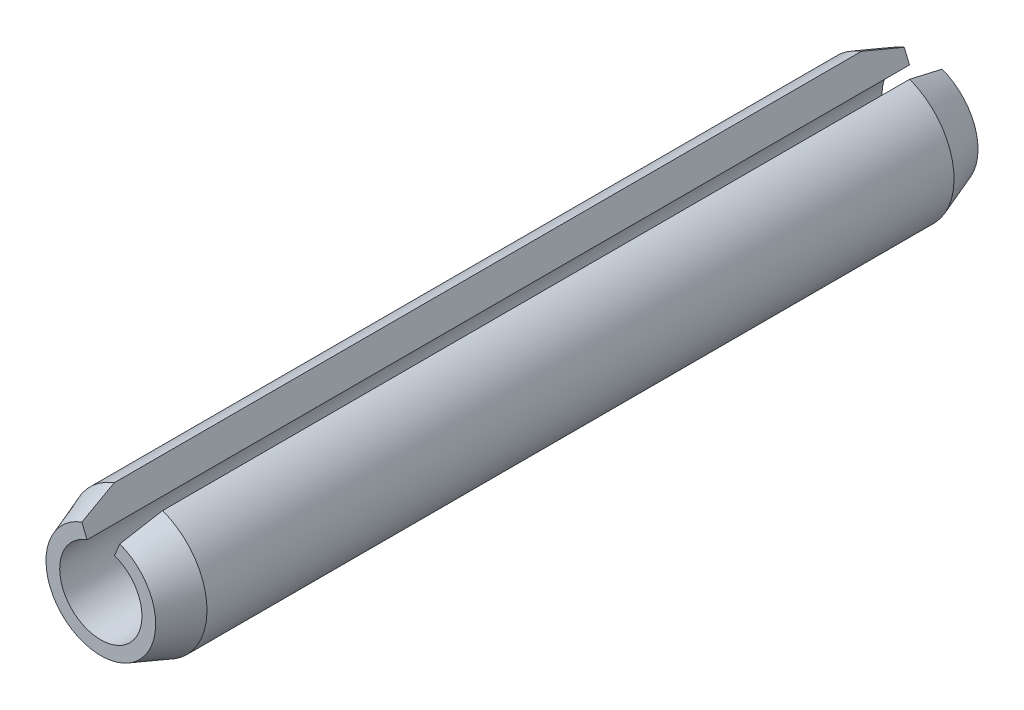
ISO-10303-21;
HEADER;
FILE_DESCRIPTION(('STEP AP214'),'2;1');
FILE_NAME('part.step','',(''),(''),'','','');
FILE_SCHEMA(('AUTOMOTIVE_DESIGN { 1 0 10303 214 1 1 1 1 }'));
ENDSEC;
DATA;
#1=APPLICATION_CONTEXT('core data for automotive mechanical design processes');
#2=APPLICATION_PROTOCOL_DEFINITION('international standard','automotive_design',2000,#1);
#3=PRODUCT_CONTEXT('',#1,'mechanical');
#4=PRODUCT('Part','Part','',(#3));
#5=PRODUCT_RELATED_PRODUCT_CATEGORY('part','',(#4));
#6=PRODUCT_DEFINITION_FORMATION('','',#4);
#7=PRODUCT_DEFINITION_CONTEXT('part definition',#1,'design');
#8=PRODUCT_DEFINITION('design','',#6,#7);
#9=PRODUCT_DEFINITION_SHAPE('','',#8);
#10=(LENGTH_UNIT() NAMED_UNIT(*) SI_UNIT(.MILLI.,.METRE.));
#11=(NAMED_UNIT(*) PLANE_ANGLE_UNIT() SI_UNIT($,.RADIAN.));
#12=(NAMED_UNIT(*) SI_UNIT($,.STERADIAN.) SOLID_ANGLE_UNIT());
#13=UNCERTAINTY_MEASURE_WITH_UNIT(LENGTH_MEASURE(1.E-05),#10,'distance_accuracy_value','');
#14=(GEOMETRIC_REPRESENTATION_CONTEXT(3) GLOBAL_UNCERTAINTY_ASSIGNED_CONTEXT((#13)) GLOBAL_UNIT_ASSIGNED_CONTEXT((#10,
#11,#12)) REPRESENTATION_CONTEXT('',''));
#15=CARTESIAN_POINT('',(0.,0.,0.));
#16=DIRECTION('',(0.,0.,1.));
#17=DIRECTION('',(1.,0.,0.));
#18=AXIS2_PLACEMENT_3D('',#15,#16,#17);
#19=CARTESIAN_POINT('',(0.,0.,30.));
#20=DIRECTION('',(0.,0.,-1.));
#21=DIRECTION('',(-1.,0.,0.));
#22=AXIS2_PLACEMENT_3D('',#19,#20,#21);
#23=CYLINDRICAL_SURFACE('',#22,3.);
#24=CARTESIAN_POINT('',(0.,0.,-30.));
#25=DIRECTION('',(0.,0.,1.));
#26=DIRECTION('',(0.,1.,0.));
#27=AXIS2_PLACEMENT_3D('',#24,#25,#26);
#28=CIRCLE('',#27,3.);
#29=CARTESIAN_POINT('',(-1.,2.82842712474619,-30.));
#30=VERTEX_POINT('',#29);
#31=CARTESIAN_POINT('',(1.,2.82842712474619,-30.));
#32=VERTEX_POINT('',#31);
#33=EDGE_CURVE('E74',#30,#32,#28,.T.);
#34=ORIENTED_EDGE('',*,*,#33,.F.);
#35=DIRECTION('',(0.,0.,-1.));
#36=VECTOR('',#35,1.);
#37=CARTESIAN_POINT('',(-1.,2.82842712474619,30.));
#38=LINE('',#37,#36);
#39=CARTESIAN_POINT('',(-1.,2.82842712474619,30.));
#40=VERTEX_POINT('',#39);
#41=EDGE_CURVE('E106',#40,#30,#38,.T.);
#42=ORIENTED_EDGE('',*,*,#41,.F.);
#43=CARTESIAN_POINT('',(0.,0.,30.));
#44=DIRECTION('',(0.,0.,1.));
#45=DIRECTION('',(0.,1.,0.));
#46=AXIS2_PLACEMENT_3D('',#43,#44,#45);
#47=CIRCLE('',#46,3.);
#48=CARTESIAN_POINT('',(1.,2.82842712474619,30.));
#49=VERTEX_POINT('',#48);
#50=EDGE_CURVE('E76',#40,#49,#47,.T.);
#51=ORIENTED_EDGE('',*,*,#50,.T.);
#52=DIRECTION('',(0.,0.,-1.));
#53=VECTOR('',#52,1.);
#54=CARTESIAN_POINT('',(1.,2.82842712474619,30.));
#55=LINE('',#54,#53);
#56=EDGE_CURVE('E70',#49,#32,#55,.T.);
#57=ORIENTED_EDGE('',*,*,#56,.T.);
#58=EDGE_LOOP('',(#34,#42,#51,#57));
#59=FACE_BOUND('',#58,.T.);
#60=ADVANCED_FACE('F14',(#59),#23,.F.);
#61=CARTESIAN_POINT('',(1.,2.82842712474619,30.));
#62=DIRECTION('',(-0.924624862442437,0.380879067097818,0.));
#63=DIRECTION('',(-0.380879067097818,-0.924624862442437,0.));
#64=AXIS2_PLACEMENT_3D('',#61,#62,#63);
#65=PLANE('',#64);
#66=DIRECTION('',(0.,0.,-1.));
#67=VECTOR('',#66,1.);
#68=CARTESIAN_POINT('',(1.7623506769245,4.67911531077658,30.));
#69=LINE('',#68,#67);
#70=CARTESIAN_POINT('',(1.7623506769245,4.67911531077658,27.2525225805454));
#71=VERTEX_POINT('',#70);
#72=CARTESIAN_POINT('',(1.7623506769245,4.67911531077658,-27.2525225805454));
#73=VERTEX_POINT('',#72);
#74=EDGE_CURVE('E81',#71,#73,#69,.T.);
#75=ORIENTED_EDGE('',*,*,#74,.T.);
#76=CARTESIAN_POINT('',(1.7623506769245,4.67911531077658,-27.2525225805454));
#77=CARTESIAN_POINT('',(1.69884108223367,4.52493894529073,-27.7104424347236));
#78=CARTESIAN_POINT('',(1.63532785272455,4.37075375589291,-28.168358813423));
#79=CARTESIAN_POINT('',(1.5082941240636,4.06236572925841,-29.0841846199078));
#80=CARTESIAN_POINT('',(1.44477362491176,3.90816289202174,-29.5420940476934));
#81=CARTESIAN_POINT('',(1.38124949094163,3.75395123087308,-30.));
#82=B_SPLINE_CURVE_WITH_KNOTS('',3,(#76,#77,#78,#79,#80,#81),.UNSPECIFIED.,.F.,.F.,(4,2,4),(0.,
1.46200195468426,2.92400390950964),.UNSPECIFIED.);
#83=CARTESIAN_POINT('',(1.38124949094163,3.75395123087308,-30.));
#84=VERTEX_POINT('',#83);
#85=EDGE_CURVE('E9',#73,#84,#82,.T.);
#86=ORIENTED_EDGE('',*,*,#85,.T.);
#87=DIRECTION('',(0.380879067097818,0.924624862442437,0.));
#88=VECTOR('',#87,1.);
#89=CARTESIAN_POINT('',(1.,2.82842712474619,-30.));
#90=LINE('',#89,#88);
#91=EDGE_CURVE('E84',#32,#84,#90,.T.);
#92=ORIENTED_EDGE('',*,*,#91,.F.);
#93=ORIENTED_EDGE('',*,*,#56,.F.);
#94=DIRECTION('',(0.380879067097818,0.924624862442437,0.));
#95=VECTOR('',#94,1.);
#96=CARTESIAN_POINT('',(1.,2.82842712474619,30.));
#97=LINE('',#96,#95);
#98=CARTESIAN_POINT('',(1.38124949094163,3.75395123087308,30.));
#99=VERTEX_POINT('',#98);
#100=EDGE_CURVE('E102',#49,#99,#97,.T.);
#101=ORIENTED_EDGE('',*,*,#100,.T.);
#102=CARTESIAN_POINT('',(1.38124949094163,3.75395123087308,30.));
#103=CARTESIAN_POINT('',(1.44477362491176,3.90816289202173,29.5420940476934));
#104=CARTESIAN_POINT('',(1.50829412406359,4.06236572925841,29.0841846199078));
#105=CARTESIAN_POINT('',(1.63532785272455,4.37075375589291,28.1683588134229));
#106=CARTESIAN_POINT('',(1.69884108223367,4.52493894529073,27.7104424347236));
#107=CARTESIAN_POINT('',(1.7623506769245,4.67911531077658,27.2525225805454));
#108=B_SPLINE_CURVE_WITH_KNOTS('',3,(#102,#103,#104,#105,#106,#107),.UNSPECIFIED.,.F.,.F.,(4,2,
4),(0.,1.46200195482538,2.92400390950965),.UNSPECIFIED.);
#109=EDGE_CURVE('E135',#99,#71,#108,.T.);
#110=ORIENTED_EDGE('',*,*,#109,.T.);
#111=EDGE_LOOP('',(#75,#86,#92,#93,#101,#110));
#112=FACE_BOUND('',#111,.T.);
#113=ADVANCED_FACE('F85',(#112),#65,.T.);
#114=CARTESIAN_POINT('',(0.,0.,30.));
#115=DIRECTION('',(0.,0.,-1.));
#116=DIRECTION('',(-1.,0.,0.));
#117=AXIS2_PLACEMENT_3D('',#114,#115,#116);
#118=CYLINDRICAL_SURFACE('',#117,5.);
#119=DIRECTION('',(0.,0.,-1.));
#120=VECTOR('',#119,1.);
#121=CARTESIAN_POINT('',(-1.76235067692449,4.67911531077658,30.));
#122=LINE('',#121,#120);
#123=CARTESIAN_POINT('',(-1.76235067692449,4.67911531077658,27.2525225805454));
#124=VERTEX_POINT('',#123);
#125=CARTESIAN_POINT('',(-1.76235067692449,4.67911531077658,-27.2525225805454));
#126=VERTEX_POINT('',#125);
#127=EDGE_CURVE('E109',#124,#126,#122,.T.);
#128=ORIENTED_EDGE('',*,*,#127,.T.);
#129=CARTESIAN_POINT('',(0.,0.,-27.2525225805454));
#130=DIRECTION('',(0.,0.,1.));
#131=DIRECTION('',(1.,0.,0.));
#132=AXIS2_PLACEMENT_3D('',#129,#130,#131);
#133=CIRCLE('',#132,5.);
#134=EDGE_CURVE('E25',#126,#73,#133,.T.);
#135=ORIENTED_EDGE('',*,*,#134,.T.);
#136=ORIENTED_EDGE('',*,*,#74,.F.);
#137=CARTESIAN_POINT('',(0.,0.,27.2525225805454));
#138=DIRECTION('',(0.,0.,1.));
#139=DIRECTION('',(1.,0.,0.));
#140=AXIS2_PLACEMENT_3D('',#137,#138,#139);
#141=CIRCLE('',#140,5.);
#142=EDGE_CURVE('E80',#71,#124,#141,.F.);
#143=ORIENTED_EDGE('',*,*,#142,.T.);
#144=EDGE_LOOP('',(#128,#135,#136,#143));
#145=FACE_BOUND('',#144,.T.);
#146=ADVANCED_FACE('F144',(#145),#118,.T.);
#147=CARTESIAN_POINT('',(-1.,2.82842712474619,30.));
#148=DIRECTION('',(0.924624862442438,0.380879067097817,0.));
#149=DIRECTION('',(-0.380879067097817,0.924624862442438,0.));
#150=AXIS2_PLACEMENT_3D('',#147,#148,#149);
#151=PLANE('',#150);
#152=DIRECTION('',(0.380879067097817,-0.924624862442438,0.));
#153=VECTOR('',#152,1.);
#154=CARTESIAN_POINT('',(-1.,2.82842712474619,-30.));
#155=LINE('',#154,#153);
#156=CARTESIAN_POINT('',(-1.38124949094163,3.75395123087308,-30.));
#157=VERTEX_POINT('',#156);
#158=EDGE_CURVE('E91',#157,#30,#155,.T.);
#159=ORIENTED_EDGE('',*,*,#158,.F.);
#160=CARTESIAN_POINT('',(-1.38124949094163,3.75395123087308,-30.));
#161=CARTESIAN_POINT('',(-1.44477362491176,3.90816289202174,-29.5420940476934));
#162=CARTESIAN_POINT('',(-1.50829412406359,4.06236572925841,-29.0841846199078));
#163=CARTESIAN_POINT('',(-1.63532785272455,4.37075375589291,-28.168358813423));
#164=CARTESIAN_POINT('',(-1.69884108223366,4.52493894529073,-27.7104424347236));
#165=CARTESIAN_POINT('',(-1.76235067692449,4.67911531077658,-27.2525225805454));
#166=B_SPLINE_CURVE_WITH_KNOTS('',3,(#160,#161,#162,#163,#164,#165),.UNSPECIFIED.,.F.,.F.,(4,2,
4),(0.,1.46200195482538,2.92400390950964),.UNSPECIFIED.);
#167=EDGE_CURVE('E39',#157,#126,#166,.T.);
#168=ORIENTED_EDGE('',*,*,#167,.T.);
#169=ORIENTED_EDGE('',*,*,#127,.F.);
#170=CARTESIAN_POINT('',(-1.76235067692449,4.67911531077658,27.2525225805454));
#171=CARTESIAN_POINT('',(-1.69884108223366,4.52493894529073,27.7104424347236));
#172=CARTESIAN_POINT('',(-1.63532785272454,4.37075375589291,28.1683588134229));
#173=CARTESIAN_POINT('',(-1.50829412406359,4.06236572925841,29.0841846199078));
#174=CARTESIAN_POINT('',(-1.44477362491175,3.90816289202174,29.5420940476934));
#175=CARTESIAN_POINT('',(-1.38124949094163,3.75395123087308,30.));
#176=B_SPLINE_CURVE_WITH_KNOTS('',3,(#170,#171,#172,#173,#174,#175),.UNSPECIFIED.,.F.,.F.,(4,2,
4),(0.,1.46200195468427,2.92400390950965),.UNSPECIFIED.);
#177=CARTESIAN_POINT('',(-1.38124949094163,3.75395123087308,30.));
#178=VERTEX_POINT('',#177);
#179=EDGE_CURVE('E114',#124,#178,#176,.T.);
#180=ORIENTED_EDGE('',*,*,#179,.T.);
#181=DIRECTION('',(0.380879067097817,-0.924624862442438,0.));
#182=VECTOR('',#181,1.);
#183=CARTESIAN_POINT('',(-1.,2.82842712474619,30.));
#184=LINE('',#183,#182);
#185=EDGE_CURVE('E104',#178,#40,#184,.T.);
#186=ORIENTED_EDGE('',*,*,#185,.T.);
#187=ORIENTED_EDGE('',*,*,#41,.T.);
#188=EDGE_LOOP('',(#159,#168,#169,#180,#186,#187));
#189=FACE_BOUND('',#188,.T.);
#190=ADVANCED_FACE('F123',(#189),#151,.T.);
#191=CARTESIAN_POINT('',(0.,0.,30.));
#192=DIRECTION('',(0.,0.,1.));
#193=DIRECTION('',(1.,0.,0.));
#194=AXIS2_PLACEMENT_3D('',#191,#192,#193);
#195=PLANE('',#194);
#196=ORIENTED_EDGE('',*,*,#185,.F.);
#197=CARTESIAN_POINT('',(0.,0.,30.));
#198=DIRECTION('',(0.,0.,1.));
#199=DIRECTION('',(1.,0.,0.));
#200=AXIS2_PLACEMENT_3D('',#197,#198,#199);
#201=CIRCLE('',#200,4.);
#202=EDGE_CURVE('E121',#178,#99,#201,.T.);
#203=ORIENTED_EDGE('',*,*,#202,.T.);
#204=ORIENTED_EDGE('',*,*,#100,.F.);
#205=ORIENTED_EDGE('',*,*,#50,.F.);
#206=EDGE_LOOP('',(#196,#203,#204,#205));
#207=FACE_BOUND('',#206,.T.);
#208=ADVANCED_FACE('F151',(#207),#195,.T.);
#209=CARTESIAN_POINT('',(0.,0.,-30.));
#210=DIRECTION('',(0.,0.,1.));
#211=DIRECTION('',(1.,0.,0.));
#212=AXIS2_PLACEMENT_3D('',#209,#210,#211);
#213=PLANE('',#212);
#214=ORIENTED_EDGE('',*,*,#91,.T.);
#215=CARTESIAN_POINT('',(0.,0.,-30.));
#216=DIRECTION('',(0.,0.,1.));
#217=DIRECTION('',(1.,0.,0.));
#218=AXIS2_PLACEMENT_3D('',#215,#216,#217);
#219=CIRCLE('',#218,4.00000000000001);
#220=EDGE_CURVE('E140',#84,#157,#219,.F.);
#221=ORIENTED_EDGE('',*,*,#220,.T.);
#222=ORIENTED_EDGE('',*,*,#158,.T.);
#223=ORIENTED_EDGE('',*,*,#33,.T.);
#224=EDGE_LOOP('',(#214,#221,#222,#223));
#225=FACE_BOUND('',#224,.T.);
#226=ADVANCED_FACE('F93',(#225),#213,.F.);
#227=CARTESIAN_POINT('',(0.,0.,27.2525225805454));
#228=DIRECTION('',(0.,0.,-1.));
#229=DIRECTION('',(-1.,0.,0.));
#230=AXIS2_PLACEMENT_3D('',#227,#228,#229);
#231=CONICAL_SURFACE('',#230,5.,0.349065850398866);
#232=ORIENTED_EDGE('',*,*,#109,.F.);
#233=ORIENTED_EDGE('',*,*,#202,.F.);
#234=ORIENTED_EDGE('',*,*,#179,.F.);
#235=ORIENTED_EDGE('',*,*,#142,.F.);
#236=EDGE_LOOP('',(#232,#233,#234,#235));
#237=FACE_BOUND('',#236,.T.);
#238=ADVANCED_FACE('F127',(#237),#231,.T.);
#239=CARTESIAN_POINT('',(0.,0.,-30.));
#240=DIRECTION('',(0.,0.,1.));
#241=DIRECTION('',(1.,0.,0.));
#242=AXIS2_PLACEMENT_3D('',#239,#240,#241);
#243=CONICAL_SURFACE('',#242,4.00000000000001,0.349065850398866);
#244=ORIENTED_EDGE('',*,*,#85,.F.);
#245=ORIENTED_EDGE('',*,*,#134,.F.);
#246=ORIENTED_EDGE('',*,*,#167,.F.);
#247=ORIENTED_EDGE('',*,*,#220,.F.);
#248=EDGE_LOOP('',(#244,#245,#246,#247));
#249=FACE_BOUND('',#248,.T.);
#250=ADVANCED_FACE('F131',(#249),#243,.T.);
#251=CLOSED_SHELL('',(#60,#113,#146,#190,#208,#226,#238,#250));
#252=MANIFOLD_SOLID_BREP('B1',#251);
#253=ADVANCED_BREP_SHAPE_REPRESENTATION('',(#18,#252),#14);
#254=SHAPE_DEFINITION_REPRESENTATION(#9,#253);
ENDSEC;
END-ISO-10303-21;
